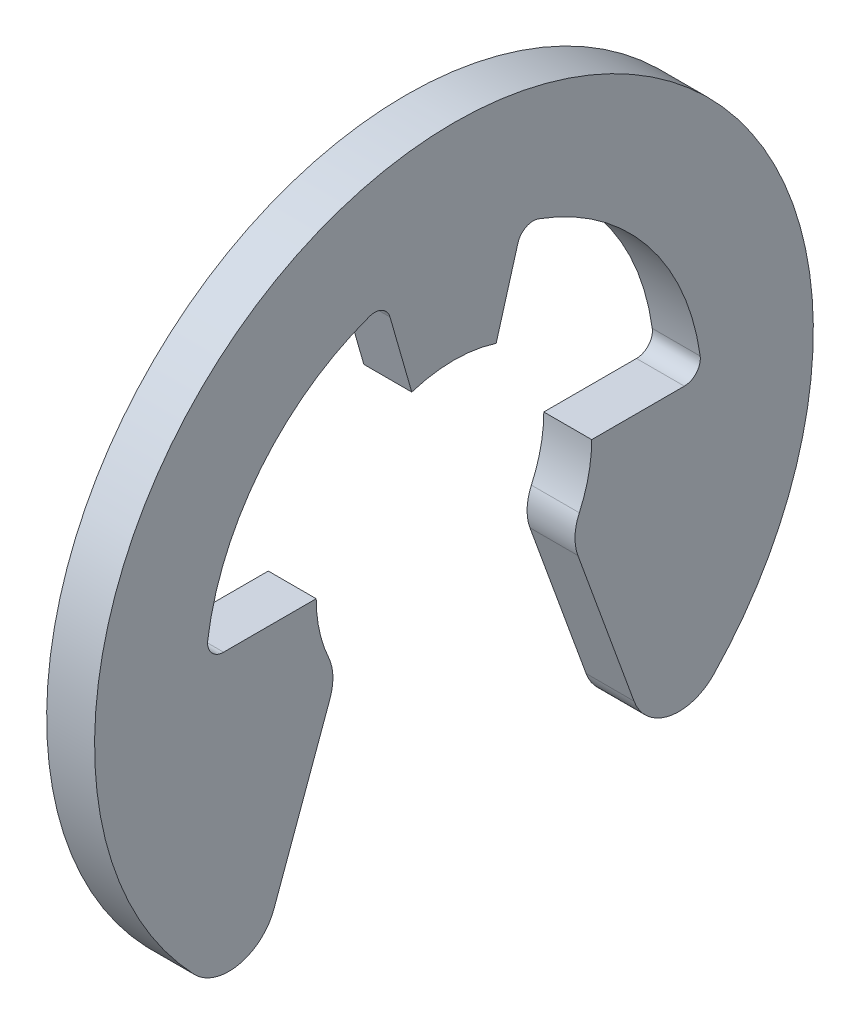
from build123d import *

# Parameters (mm, degrees)
BASE_EXTRUSION_DEPTH = 0.4


with BuildPart() as part:
    # Esquisse1 → Base-Extrusion (new body)
    with BuildSketch(Plane(origin=(0, 0, 0), x_dir=(0, 0, -1), z_dir=(1, 0, 0))):
        with BuildLine():
            Line((0.352149, 1.228089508), (0.533932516, 1.862043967))
            ThreePointArc((0.533932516, 1.862043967), (0.601503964, 1.944060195), (0.707566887, 1.950634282))
            ThreePointArc((0.707566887, 1.950634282), (1.613075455, 1.305225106), (2.055337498, 0.284978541))
            ThreePointArc((2.055337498, 0.284978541), (2.023814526, 0.179098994), (1.923267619, 0.133333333))
            Line((1.923267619, 0.133333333), (1.15, 0.133333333))
            ThreePointArc((1.15, 0.133333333), (1.123793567, -0.110773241), (1.046368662, -0.343754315))
            ThreePointArc((1.046368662, -0.343754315), (1.010632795, -0.493957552), (1.03444593, -0.646505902))
            Line((1.03444593, -0.646505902), (1.503034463, -1.933942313))
            ThreePointArc((1.503034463, -1.933942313), (1.796683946, -2.188591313), (2.16797482, -2.073616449))
            ThreePointArc((2.16797482, -2.073616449), (0, 3), (-2.16797482, -2.073616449))
            ThreePointArc((-2.16797482, -2.073616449), (-1.796683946, -2.188591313), (-1.503034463, -1.933942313))
            Line((-1.503034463, -1.933942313), (-1.03444593, -0.646505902))
            ThreePointArc((-1.03444593, -0.646505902), (-1.010632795, -0.493957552), (-1.046368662, -0.343754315))
            ThreePointArc((-1.046368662, -0.343754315), (-1.123793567, -0.110773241), (-1.15, 0.133333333))
            Line((-1.15, 0.133333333), (-1.923267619, 0.133333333))
            ThreePointArc((-1.923267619, 0.133333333), (-2.023814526, 0.179098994), (-2.055337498, 0.284978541))
            ThreePointArc((-2.055337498, 0.284978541), (-1.613075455, 1.305225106), (-0.707566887, 1.950634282))
            ThreePointArc((-0.707566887, 1.950634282), (-0.601503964, 1.944060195), (-0.533932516, 1.862043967))
            Line((-0.533932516, 1.862043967), (-0.352149, 1.228089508))
            ThreePointArc((-0.352149, 1.228089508), (0, 1.283333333), (0.352149, 1.228089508))
        make_face()
    extrude(amount=BASE_EXTRUSION_DEPTH)


solid = part.part
